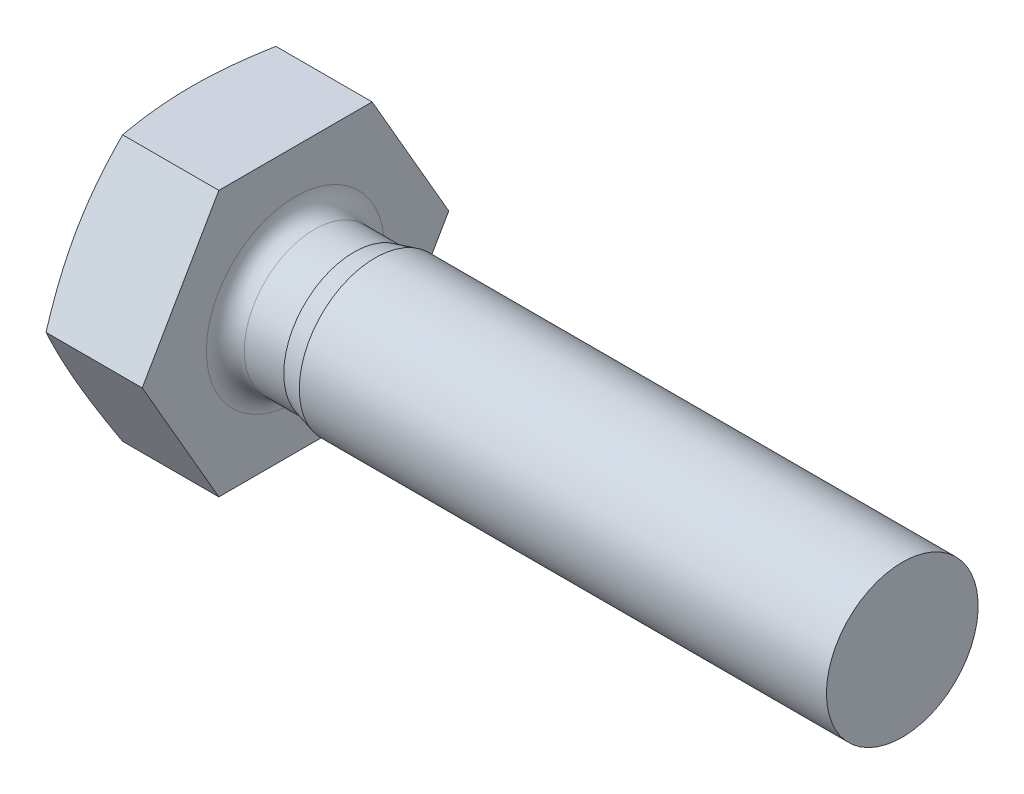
ISO-10303-21;
HEADER;
FILE_DESCRIPTION(('STEP AP214'),'2;1');
FILE_NAME('part.step','',(''),(''),'','','');
FILE_SCHEMA(('AUTOMOTIVE_DESIGN { 1 0 10303 214 1 1 1 1 }'));
ENDSEC;
DATA;
#1=APPLICATION_CONTEXT('core data for automotive mechanical design processes');
#2=APPLICATION_PROTOCOL_DEFINITION('international standard','automotive_design',2000,#1);
#3=PRODUCT_CONTEXT('',#1,'mechanical');
#4=PRODUCT('Part','Part','',(#3));
#5=PRODUCT_RELATED_PRODUCT_CATEGORY('part','',(#4));
#6=PRODUCT_DEFINITION_FORMATION('','',#4);
#7=PRODUCT_DEFINITION_CONTEXT('part definition',#1,'design');
#8=PRODUCT_DEFINITION('design','',#6,#7);
#9=PRODUCT_DEFINITION_SHAPE('','',#8);
#10=(LENGTH_UNIT() NAMED_UNIT(*) SI_UNIT(.MILLI.,.METRE.));
#11=(NAMED_UNIT(*) PLANE_ANGLE_UNIT() SI_UNIT($,.RADIAN.));
#12=(NAMED_UNIT(*) SI_UNIT($,.STERADIAN.) SOLID_ANGLE_UNIT());
#13=UNCERTAINTY_MEASURE_WITH_UNIT(LENGTH_MEASURE(1.E-05),#10,'distance_accuracy_value','');
#14=(GEOMETRIC_REPRESENTATION_CONTEXT(3) GLOBAL_UNCERTAINTY_ASSIGNED_CONTEXT((#13)) GLOBAL_UNIT_ASSIGNED_CONTEXT((#10,
#11,#12)) REPRESENTATION_CONTEXT('',''));
#15=CARTESIAN_POINT('',(0.,0.,0.));
#16=DIRECTION('',(0.,0.,1.));
#17=DIRECTION('',(1.,0.,0.));
#18=AXIS2_PLACEMENT_3D('',#15,#16,#17);
#19=CARTESIAN_POINT('',(1.8,0.,0.));
#20=DIRECTION('',(-1.,0.,0.));
#21=DIRECTION('',(0.,0.,1.));
#22=AXIS2_PLACEMENT_3D('',#19,#20,#21);
#23=PLANE('',#22);
#24=CARTESIAN_POINT('',(1.8,0.,0.));
#25=DIRECTION('',(-1.,0.,0.));
#26=DIRECTION('',(0.,0.,1.));
#27=AXIS2_PLACEMENT_3D('',#24,#25,#26);
#28=CIRCLE('',#27,3.32);
#29=CARTESIAN_POINT('',(1.8,0.,3.32));
#30=VERTEX_POINT('',#29);
#31=EDGE_CURVE('E237',#30,#30,#28,.T.);
#32=ORIENTED_EDGE('',*,*,#31,.T.);
#33=EDGE_LOOP('',(#32));
#34=FACE_BOUND('',#33,.T.);
#35=DIRECTION('',(0.,0.,-1.));
#36=VECTOR('',#35,1.);
#37=CARTESIAN_POINT('',(1.8,2.,0.));
#38=LINE('',#37,#36);
#39=CARTESIAN_POINT('',(1.8,2.,0.385999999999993));
#40=VERTEX_POINT('',#39);
#41=CARTESIAN_POINT('',(1.8,2.,-0.386000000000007));
#42=VERTEX_POINT('',#41);
#43=EDGE_CURVE('E209',#40,#42,#38,.T.);
#44=ORIENTED_EDGE('',*,*,#43,.F.);
#45=DIRECTION('',(0.,-1.,0.));
#46=VECTOR('',#45,1.);
#47=CARTESIAN_POINT('',(1.8,0.,0.386));
#48=LINE('',#47,#46);
#49=CARTESIAN_POINT('',(1.8,0.386,0.385999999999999));
#50=VERTEX_POINT('',#49);
#51=EDGE_CURVE('E199',#40,#50,#48,.T.);
#52=ORIENTED_EDGE('',*,*,#51,.T.);
#53=DIRECTION('',(0.,0.,-1.));
#54=VECTOR('',#53,1.);
#55=CARTESIAN_POINT('',(1.8,0.386,0.));
#56=LINE('',#55,#54);
#57=CARTESIAN_POINT('',(1.8,0.386,2.));
#58=VERTEX_POINT('',#57);
#59=EDGE_CURVE('E698',#58,#50,#56,.T.);
#60=ORIENTED_EDGE('',*,*,#59,.F.);
#61=DIRECTION('',(0.,1.,0.));
#62=VECTOR('',#61,1.);
#63=CARTESIAN_POINT('',(1.8,0.,2.));
#64=LINE('',#63,#62);
#65=CARTESIAN_POINT('',(1.8,-0.386,2.));
#66=VERTEX_POINT('',#65);
#67=EDGE_CURVE('E709',#66,#58,#64,.T.);
#68=ORIENTED_EDGE('',*,*,#67,.F.);
#69=DIRECTION('',(0.,0.,-1.));
#70=VECTOR('',#69,1.);
#71=CARTESIAN_POINT('',(1.8,-0.386,0.));
#72=LINE('',#71,#70);
#73=CARTESIAN_POINT('',(1.8,-0.386,0.386000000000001));
#74=VERTEX_POINT('',#73);
#75=EDGE_CURVE('E713',#66,#74,#72,.T.);
#76=ORIENTED_EDGE('',*,*,#75,.T.);
#77=CARTESIAN_POINT('',(1.8,-2.,0.386000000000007));
#78=VERTEX_POINT('',#77);
#79=EDGE_CURVE('E203',#74,#78,#48,.T.);
#80=ORIENTED_EDGE('',*,*,#79,.T.);
#81=DIRECTION('',(0.,0.,1.));
#82=VECTOR('',#81,1.);
#83=CARTESIAN_POINT('',(1.8,-2.,0.));
#84=LINE('',#83,#82);
#85=CARTESIAN_POINT('',(1.8,-2.,-0.385999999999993));
#86=VERTEX_POINT('',#85);
#87=EDGE_CURVE('E215',#86,#78,#84,.T.);
#88=ORIENTED_EDGE('',*,*,#87,.F.);
#89=DIRECTION('',(0.,-1.,0.));
#90=VECTOR('',#89,1.);
#91=CARTESIAN_POINT('',(1.8,0.,-0.386));
#92=LINE('',#91,#90);
#93=CARTESIAN_POINT('',(1.8,-0.386,-0.385999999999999));
#94=VERTEX_POINT('',#93);
#95=EDGE_CURVE('E196',#94,#86,#92,.T.);
#96=ORIENTED_EDGE('',*,*,#95,.F.);
#97=CARTESIAN_POINT('',(1.8,-0.386,-2.));
#98=VERTEX_POINT('',#97);
#99=EDGE_CURVE('E712',#94,#98,#72,.T.);
#100=ORIENTED_EDGE('',*,*,#99,.T.);
#101=DIRECTION('',(0.,-1.,0.));
#102=VECTOR('',#101,1.);
#103=CARTESIAN_POINT('',(1.8,0.,-2.));
#104=LINE('',#103,#102);
#105=CARTESIAN_POINT('',(1.8,0.386,-2.));
#106=VERTEX_POINT('',#105);
#107=EDGE_CURVE('E706',#106,#98,#104,.T.);
#108=ORIENTED_EDGE('',*,*,#107,.F.);
#109=CARTESIAN_POINT('',(1.8,0.386,-0.386000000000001));
#110=VERTEX_POINT('',#109);
#111=EDGE_CURVE('E694',#110,#106,#56,.T.);
#112=ORIENTED_EDGE('',*,*,#111,.F.);
#113=EDGE_CURVE('E193',#42,#110,#92,.T.);
#114=ORIENTED_EDGE('',*,*,#113,.F.);
#115=EDGE_LOOP('',(#44,#52,#60,#68,#76,#80,#88,#96,#100,#108,#112,#114));
#116=FACE_BOUND('',#115,.T.);
#117=ADVANCED_FACE('F37',(#34,#116),#23,.T.);
#118=CARTESIAN_POINT('',(1.3,-0.386,2.51813471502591));
#119=DIRECTION('',(0.719587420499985,0.,0.694401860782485));
#120=DIRECTION('',(0.694401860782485,0.,-0.719587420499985));
#121=AXIS2_PLACEMENT_3D('',#118,#119,#120);
#122=PLANE('',#121);
#123=DIRECTION('',(0.,1.,0.));
#124=VECTOR('',#123,1.);
#125=CARTESIAN_POINT('',(3.35751,-0.386000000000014,0.386000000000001));
#126=LINE('',#125,#124);
#127=CARTESIAN_POINT('',(3.35751,-0.386,0.386000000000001));
#128=VERTEX_POINT('',#127);
#129=CARTESIAN_POINT('',(3.35751,0.386,0.385999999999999));
#130=VERTEX_POINT('',#129);
#131=EDGE_CURVE('E162',#128,#130,#126,.T.);
#132=ORIENTED_EDGE('',*,*,#131,.F.);
#133=DIRECTION('',(0.694401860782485,0.,-0.719587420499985));
#134=VECTOR('',#133,1.);
#135=CARTESIAN_POINT('',(1.3,-0.386,2.51813471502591));
#136=LINE('',#135,#134);
#137=EDGE_CURVE('E218',#66,#128,#136,.T.);
#138=ORIENTED_EDGE('',*,*,#137,.F.);
#139=ORIENTED_EDGE('',*,*,#67,.T.);
#140=DIRECTION('',(0.694401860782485,0.,-0.719587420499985));
#141=VECTOR('',#140,1.);
#142=CARTESIAN_POINT('',(1.3,0.386,2.51813471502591));
#143=LINE('',#142,#141);
#144=EDGE_CURVE('E226',#58,#130,#143,.T.);
#145=ORIENTED_EDGE('',*,*,#144,.T.);
#146=EDGE_LOOP('',(#132,#138,#139,#145));
#147=FACE_BOUND('',#146,.T.);
#148=ADVANCED_FACE('F324',(#147),#122,.F.);
#149=CARTESIAN_POINT('',(3.73,-0.386,0.));
#150=DIRECTION('',(0.,1.,0.));
#151=DIRECTION('',(0.,0.,1.));
#152=AXIS2_PLACEMENT_3D('',#149,#150,#151);
#153=PLANE('',#152);
#154=ORIENTED_EDGE('',*,*,#137,.T.);
#155=DIRECTION('',(-1.,0.,0.));
#156=VECTOR('',#155,1.);
#157=CARTESIAN_POINT('',(3.73,-0.386,0.386000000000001));
#158=LINE('',#157,#156);
#159=EDGE_CURVE('E202',#128,#74,#158,.T.);
#160=ORIENTED_EDGE('',*,*,#159,.T.);
#161=ORIENTED_EDGE('',*,*,#75,.F.);
#162=EDGE_LOOP('',(#154,#160,#161));
#163=FACE_BOUND('',#162,.T.);
#164=ADVANCED_FACE('F329',(#163),#153,.T.);
#165=CARTESIAN_POINT('',(3.73,0.386,0.));
#166=DIRECTION('',(0.,1.,0.));
#167=DIRECTION('',(0.,0.,1.));
#168=AXIS2_PLACEMENT_3D('',#165,#166,#167);
#169=PLANE('',#168);
#170=DIRECTION('',(-1.,0.,0.));
#171=VECTOR('',#170,1.);
#172=CARTESIAN_POINT('',(3.73,0.386,0.385999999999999));
#173=LINE('',#172,#171);
#174=EDGE_CURVE('E46',#130,#50,#173,.T.);
#175=ORIENTED_EDGE('',*,*,#174,.F.);
#176=ORIENTED_EDGE('',*,*,#144,.F.);
#177=ORIENTED_EDGE('',*,*,#59,.T.);
#178=EDGE_LOOP('',(#175,#176,#177));
#179=FACE_BOUND('',#178,.T.);
#180=ADVANCED_FACE('F351',(#179),#169,.F.);
#181=CARTESIAN_POINT('',(2.8,-3.5,2.02072594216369));
#182=DIRECTION('',(0.,1.,0.));
#183=DIRECTION('',(0.,0.,1.));
#184=AXIS2_PLACEMENT_3D('',#181,#182,#183);
#185=PLANE('',#184);
#186=CARTESIAN_POINT('',(1.11669137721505,-3.5,-5.34393315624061));
#187=CARTESIAN_POINT('',(1.06850938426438,-3.5,-5.18564432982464));
#188=CARTESIAN_POINT('',(1.02089099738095,-3.5,-5.02718074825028));
#189=CARTESIAN_POINT('',(0.927093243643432,-3.5,-4.70981511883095));
#190=CARTESIAN_POINT('',(0.880913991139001,-3.5,-4.55091303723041));
#191=CARTESIAN_POINT('',(0.790229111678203,-3.5,-4.23230809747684));
#192=CARTESIAN_POINT('',(0.745726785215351,-3.5,-4.07260429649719));
#193=CARTESIAN_POINT('',(0.658918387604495,-3.5,-3.75260173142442));
#194=CARTESIAN_POINT('',(0.616612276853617,-3.5,-3.59230297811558));
#195=CARTESIAN_POINT('',(0.53524785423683,-3.5,-3.27299631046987));
#196=CARTESIAN_POINT('',(0.496155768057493,-3.5,-3.11399704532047));
#197=CARTESIAN_POINT('',(0.421309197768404,-3.5,-2.79520645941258));
#198=CARTESIAN_POINT('',(0.385554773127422,-3.5,-2.63541512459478));
#199=CARTESIAN_POINT('',(0.318219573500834,-3.5,-2.31500785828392));
#200=CARTESIAN_POINT('',(0.286637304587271,-3.5,-2.15439224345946));
#201=CARTESIAN_POINT('',(0.228608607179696,-3.5,-1.83222517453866));
#202=CARTESIAN_POINT('',(0.202162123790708,-3.5,-1.67067373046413));
#203=CARTESIAN_POINT('',(0.158100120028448,-3.5,-1.36483588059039));
#204=CARTESIAN_POINT('',(0.139826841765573,-3.5,-1.22064512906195));
#205=CARTESIAN_POINT('',(0.108917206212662,-3.5,-0.931670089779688));
#206=CARTESIAN_POINT('',(0.0962801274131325,-3.5,-0.786885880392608));
#207=CARTESIAN_POINT('',(0.0772483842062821,-3.5,-0.496996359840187));
#208=CARTESIAN_POINT('',(0.0708496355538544,-3.5,-0.351891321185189));
#209=CARTESIAN_POINT('',(0.0646194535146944,-3.5,-0.0615388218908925));
#210=CARTESIAN_POINT('',(0.0647879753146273,-3.5,0.083708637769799));
#211=CARTESIAN_POINT('',(0.071700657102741,-3.5,0.374786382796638));
#212=CARTESIAN_POINT('',(0.0784783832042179,-3.5,0.520615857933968));
#213=CARTESIAN_POINT('',(0.09829814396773,-3.5,0.811844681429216));
#214=CARTESIAN_POINT('',(0.111340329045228,-3.5,0.957244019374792));
#215=CARTESIAN_POINT('',(0.143078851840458,-3.5,1.2475421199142));
#216=CARTESIAN_POINT('',(0.161780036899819,-3.5,1.39244034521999));
#217=CARTESIAN_POINT('',(0.204084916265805,-3.5,1.68150990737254));
#218=CARTESIAN_POINT('',(0.227688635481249,-3.5,1.8256812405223));
#219=CARTESIAN_POINT('',(0.307559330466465,-3.5,2.2732485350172));
#220=CARTESIAN_POINT('',(0.370953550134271,-3.5,2.57536900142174));
#221=CARTESIAN_POINT('',(0.509931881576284,-3.5,3.17680072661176));
#222=CARTESIAN_POINT('',(0.58552040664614,-3.5,3.47611092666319));
#223=CARTESIAN_POINT('',(0.74481592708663,-3.5,4.07295830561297));
#224=CARTESIAN_POINT('',(0.828533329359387,-3.5,4.37049267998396));
#225=CARTESIAN_POINT('',(1.00134083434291,-3.5,4.96392973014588));
#226=CARTESIAN_POINT('',(1.09043007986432,-3.5,5.25983265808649));
#227=CARTESIAN_POINT('',(1.27130419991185,-3.5,5.8471785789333));
#228=CARTESIAN_POINT('',(1.36304766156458,-3.5,6.13863438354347));
#229=CARTESIAN_POINT('',(1.54913199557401,-3.5,6.72072836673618));
#230=CARTESIAN_POINT('',(1.643472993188,-3.5,7.0113665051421));
#231=CARTESIAN_POINT('',(1.83368573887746,-3.5,7.59091730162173));
#232=CARTESIAN_POINT('',(1.92955031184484,-3.5,7.87983232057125));
#233=CARTESIAN_POINT('',(2.12271150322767,-3.5,8.45715716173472));
#234=CARTESIAN_POINT('',(2.22000800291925,-3.5,8.74556702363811));
#235=CARTESIAN_POINT('',(2.31780528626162,-3.5,9.03380453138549));
#236=B_SPLINE_CURVE_WITH_KNOTS('',3,(#186,#187,#188,#189,#190,#191,#192,#193,#194,#195,#196,
#197,#198,#199,#200,#201,#202,#203,#204,#205,#206,#207,#208,#209,#210,#211,#212,#213,#214,#215,
#216,#217,#218,#219,#220,#221,#222,#223,#224,#225,#226,#227,#228,#229,#230,#231,#232,#233,#234,
#235),.UNSPECIFIED.,.F.,.F.,(4,2,2,2,2,2,2,2,2,2,2,2,2,2,2,2,2,2,2,2,2,2,2,2,4),(0.,
0.49638213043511,0.992803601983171,1.49015588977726,1.98749920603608,2.47867397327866,
2.96985749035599,3.46086464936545,3.95186655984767,4.38780272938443,4.82368307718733,
5.25927786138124,5.69486967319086,6.13268530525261,6.57051145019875,7.00871369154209,
7.44691815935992,8.37256634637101,9.29855029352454,10.2257357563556,11.1527736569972,
12.0694195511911,12.9861097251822,13.8993181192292,14.8124512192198),.UNSPECIFIED.);
#237=CARTESIAN_POINT('',(0.262587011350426,-3.5,-2.02072594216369));
#238=VERTEX_POINT('',#237);
#239=CARTESIAN_POINT('',(0.262587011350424,-3.5,2.02072594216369));
#240=VERTEX_POINT('',#239);
#241=EDGE_CURVE('E295',#238,#240,#236,.T.);
#242=ORIENTED_EDGE('',*,*,#241,.F.);
#243=DIRECTION('',(-1.,0.,0.));
#244=VECTOR('',#243,1.);
#245=CARTESIAN_POINT('',(2.8,-3.5,-2.02072594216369));
#246=LINE('',#245,#244);
#247=CARTESIAN_POINT('',(2.8,-3.5,-2.02072594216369));
#248=VERTEX_POINT('',#247);
#249=EDGE_CURVE('E692',#248,#238,#246,.T.);
#250=ORIENTED_EDGE('',*,*,#249,.F.);
#251=DIRECTION('',(0.,0.,-1.));
#252=VECTOR('',#251,1.);
#253=CARTESIAN_POINT('',(2.8,-3.5,2.02072594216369));
#254=LINE('',#253,#252);
#255=CARTESIAN_POINT('',(2.8,-3.5,2.02072594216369));
#256=VERTEX_POINT('',#255);
#257=EDGE_CURVE('E680',#256,#248,#254,.T.);
#258=ORIENTED_EDGE('',*,*,#257,.F.);
#259=DIRECTION('',(-1.,0.,0.));
#260=VECTOR('',#259,1.);
#261=CARTESIAN_POINT('',(2.8,-3.5,2.02072594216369));
#262=LINE('',#261,#260);
#263=EDGE_CURVE('E760',#256,#240,#262,.T.);
#264=ORIENTED_EDGE('',*,*,#263,.T.);
#265=EDGE_LOOP('',(#242,#250,#258,#264));
#266=FACE_BOUND('',#265,.T.);
#267=ADVANCED_FACE('F39',(#266),#185,.F.);
#268=CARTESIAN_POINT('',(2.8,-3.5,-2.02072594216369));
#269=DIRECTION('',(0.,0.5,0.866025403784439));
#270=DIRECTION('',(0.,-0.866025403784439,0.5));
#271=AXIS2_PLACEMENT_3D('',#268,#269,#270);
#272=PLANE('',#271);
#273=CARTESIAN_POINT('',(0.262629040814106,0.000199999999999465,-4.04156735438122));
#274=CARTESIAN_POINT('',(0.232154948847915,-0.144759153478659,-3.95787514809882));
#275=CARTESIAN_POINT('',(0.204433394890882,-0.290196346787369,-3.87390694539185));
#276=CARTESIAN_POINT('',(0.155661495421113,-0.582016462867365,-3.70542452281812));
#277=CARTESIAN_POINT('',(0.134616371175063,-0.728400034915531,-3.62090992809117));
#278=CARTESIAN_POINT('',(0.100576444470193,-1.02048824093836,-3.45227272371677));
#279=CARTESIAN_POINT('',(0.0875073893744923,-1.16618620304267,-3.36815396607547));
#280=CARTESIAN_POINT('',(0.0699781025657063,-1.45792287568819,-3.1997197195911));
#281=CARTESIAN_POINT('',(0.0655146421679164,-1.60396143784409,-3.11540431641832));
#282=CARTESIAN_POINT('',(0.0655146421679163,-1.89603856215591,-2.94677351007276));
#283=CARTESIAN_POINT('',(0.0699781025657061,-2.04207712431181,-2.86245810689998));
#284=CARTESIAN_POINT('',(0.0875073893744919,-2.33381379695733,-2.69402386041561));
#285=CARTESIAN_POINT('',(0.100576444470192,-2.47951175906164,-2.6099051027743));
#286=CARTESIAN_POINT('',(0.134616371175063,-2.77159996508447,-2.44126789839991));
#287=CARTESIAN_POINT('',(0.155661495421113,-2.91798353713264,-2.35675330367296));
#288=CARTESIAN_POINT('',(0.204433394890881,-3.20980365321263,-2.18827088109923));
#289=CARTESIAN_POINT('',(0.232154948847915,-3.35524084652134,-2.10430267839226));
#290=CARTESIAN_POINT('',(0.262629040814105,-3.5002,-2.02061047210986));
#291=B_SPLINE_CURVE_WITH_KNOTS('',3,(#273,#274,#275,#276,#277,#278,#279,#280,#281,#282,#283,
#284,#285,#286,#287,#288,#289,#290),.UNSPECIFIED.,.F.,.F.,(4,2,2,2,2,2,2,2,4),(0.,
0.510460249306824,1.02131872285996,1.52734581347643,2.03318301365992,2.53902021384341,
3.04504730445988,3.55590577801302,4.06636602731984),.UNSPECIFIED.);
#292=CARTESIAN_POINT('',(0.262587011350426,0.,-4.04145188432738));
#293=VERTEX_POINT('',#292);
#294=EDGE_CURVE('E290',#293,#238,#291,.T.);
#295=ORIENTED_EDGE('',*,*,#294,.F.);
#296=DIRECTION('',(-1.,0.,0.));
#297=VECTOR('',#296,1.);
#298=CARTESIAN_POINT('',(2.8,0.,-4.04145188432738));
#299=LINE('',#298,#297);
#300=CARTESIAN_POINT('',(2.8,0.,-4.04145188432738));
#301=VERTEX_POINT('',#300);
#302=EDGE_CURVE('E695',#301,#293,#299,.T.);
#303=ORIENTED_EDGE('',*,*,#302,.F.);
#304=DIRECTION('',(0.,0.866025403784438,-0.5));
#305=VECTOR('',#304,1.);
#306=CARTESIAN_POINT('',(2.8,-3.5,-2.02072594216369));
#307=LINE('',#306,#305);
#308=EDGE_CURVE('E682',#248,#301,#307,.T.);
#309=ORIENTED_EDGE('',*,*,#308,.F.);
#310=ORIENTED_EDGE('',*,*,#249,.T.);
#311=EDGE_LOOP('',(#295,#303,#309,#310));
#312=FACE_BOUND('',#311,.T.);
#313=ADVANCED_FACE('F301',(#312),#272,.F.);
#314=CARTESIAN_POINT('',(2.8,0.,-4.04145188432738));
#315=DIRECTION('',(0.,-0.5,0.866025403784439));
#316=DIRECTION('',(0.,-0.866025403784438,-0.5));
#317=AXIS2_PLACEMENT_3D('',#314,#315,#316);
#318=PLANE('',#317);
#319=CARTESIAN_POINT('',(0.262629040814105,3.5002,-2.02061047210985));
#320=CARTESIAN_POINT('',(0.232154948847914,3.35524084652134,-2.10430267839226));
#321=CARTESIAN_POINT('',(0.204433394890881,3.20980365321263,-2.18827088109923));
#322=CARTESIAN_POINT('',(0.155661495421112,2.91798353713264,-2.35675330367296));
#323=CARTESIAN_POINT('',(0.134616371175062,2.77159996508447,-2.44126789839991));
#324=CARTESIAN_POINT('',(0.100576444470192,2.47951175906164,-2.6099051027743));
#325=CARTESIAN_POINT('',(0.0875073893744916,2.33381379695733,-2.69402386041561));
#326=CARTESIAN_POINT('',(0.0699781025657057,2.04207712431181,-2.86245810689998));
#327=CARTESIAN_POINT('',(0.0655146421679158,1.89603856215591,-2.94677351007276));
#328=CARTESIAN_POINT('',(0.0655146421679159,1.60396143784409,-3.11540431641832));
#329=CARTESIAN_POINT('',(0.0699781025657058,1.45792287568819,-3.19971971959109));
#330=CARTESIAN_POINT('',(0.0875073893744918,1.16618620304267,-3.36815396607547));
#331=CARTESIAN_POINT('',(0.100576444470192,1.02048824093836,-3.45227272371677));
#332=CARTESIAN_POINT('',(0.134616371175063,0.72840003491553,-3.62090992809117));
#333=CARTESIAN_POINT('',(0.155661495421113,0.582016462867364,-3.70542452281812));
#334=CARTESIAN_POINT('',(0.204433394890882,0.290196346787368,-3.87390694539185));
#335=CARTESIAN_POINT('',(0.232154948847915,0.144759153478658,-3.95787514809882));
#336=CARTESIAN_POINT('',(0.262629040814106,-0.000200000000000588,-4.04156735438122));
#337=B_SPLINE_CURVE_WITH_KNOTS('',3,(#319,#320,#321,#322,#323,#324,#325,#326,#327,#328,#329,
#330,#331,#332,#333,#334,#335,#336),.UNSPECIFIED.,.F.,.F.,(4,2,2,2,2,2,2,2,4),(0.,
0.510460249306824,1.02131872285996,1.52734581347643,2.03318301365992,2.53902021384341,
3.04504730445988,3.55590577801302,4.06636602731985),.UNSPECIFIED.);
#338=CARTESIAN_POINT('',(0.262587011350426,3.5,-2.0207259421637));
#339=VERTEX_POINT('',#338);
#340=EDGE_CURVE('E283',#339,#293,#337,.T.);
#341=ORIENTED_EDGE('',*,*,#340,.F.);
#342=DIRECTION('',(-1.,0.,0.));
#343=VECTOR('',#342,1.);
#344=CARTESIAN_POINT('',(2.8,3.5,-2.02072594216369));
#345=LINE('',#344,#343);
#346=CARTESIAN_POINT('',(2.8,3.5,-2.02072594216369));
#347=VERTEX_POINT('',#346);
#348=EDGE_CURVE('E701',#347,#339,#345,.T.);
#349=ORIENTED_EDGE('',*,*,#348,.F.);
#350=DIRECTION('',(0.,0.866025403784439,0.5));
#351=VECTOR('',#350,1.);
#352=CARTESIAN_POINT('',(2.8,0.,-4.04145188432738));
#353=LINE('',#352,#351);
#354=EDGE_CURVE('E767',#301,#347,#353,.T.);
#355=ORIENTED_EDGE('',*,*,#354,.F.);
#356=ORIENTED_EDGE('',*,*,#302,.T.);
#357=EDGE_LOOP('',(#341,#349,#355,#356));
#358=FACE_BOUND('',#357,.T.);
#359=ADVANCED_FACE('F304',(#358),#318,.F.);
#360=CARTESIAN_POINT('',(2.8,3.5,-2.02072594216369));
#361=DIRECTION('',(0.,-1.,0.));
#362=DIRECTION('',(0.,0.,-1.));
#363=AXIS2_PLACEMENT_3D('',#360,#361,#362);
#364=PLANE('',#363);
#365=CARTESIAN_POINT('',(1.11669137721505,3.5,-5.34393315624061));
#366=CARTESIAN_POINT('',(1.06850938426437,3.5,-5.18564432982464));
#367=CARTESIAN_POINT('',(1.02089099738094,3.5,-5.02718074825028));
#368=CARTESIAN_POINT('',(0.92709324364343,3.5,-4.70981511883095));
#369=CARTESIAN_POINT('',(0.880913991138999,3.5,-4.55091303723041));
#370=CARTESIAN_POINT('',(0.790229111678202,3.5,-4.23230809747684));
#371=CARTESIAN_POINT('',(0.745726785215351,3.5,-4.07260429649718));
#372=CARTESIAN_POINT('',(0.658918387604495,3.5,-3.75260173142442));
#373=CARTESIAN_POINT('',(0.616612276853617,3.5,-3.59230297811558));
#374=CARTESIAN_POINT('',(0.535247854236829,3.5,-3.27299631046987));
#375=CARTESIAN_POINT('',(0.496155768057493,3.5,-3.11399704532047));
#376=CARTESIAN_POINT('',(0.421309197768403,3.5,-2.79520645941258));
#377=CARTESIAN_POINT('',(0.385554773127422,3.5,-2.63541512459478));
#378=CARTESIAN_POINT('',(0.318219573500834,3.5,-2.31500785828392));
#379=CARTESIAN_POINT('',(0.28663730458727,3.5,-2.15439224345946));
#380=CARTESIAN_POINT('',(0.228608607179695,3.5,-1.83222517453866));
#381=CARTESIAN_POINT('',(0.202162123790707,3.5,-1.67067373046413));
#382=CARTESIAN_POINT('',(0.158100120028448,3.5,-1.36483588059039));
#383=CARTESIAN_POINT('',(0.139826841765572,3.5,-1.22064512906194));
#384=CARTESIAN_POINT('',(0.108917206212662,3.5,-0.931670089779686));
#385=CARTESIAN_POINT('',(0.0962801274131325,3.5,-0.786885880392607));
#386=CARTESIAN_POINT('',(0.0772483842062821,3.5,-0.496996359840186));
#387=CARTESIAN_POINT('',(0.0708496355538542,3.5,-0.351891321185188));
#388=CARTESIAN_POINT('',(0.0646194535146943,3.5,-0.0615388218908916));
#389=CARTESIAN_POINT('',(0.0647879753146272,3.5,0.0837086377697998));
#390=CARTESIAN_POINT('',(0.0717006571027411,3.5,0.374786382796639));
#391=CARTESIAN_POINT('',(0.0784783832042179,3.5,0.520615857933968));
#392=CARTESIAN_POINT('',(0.09829814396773,3.5,0.811844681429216));
#393=CARTESIAN_POINT('',(0.111340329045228,3.5,0.957244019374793));
#394=CARTESIAN_POINT('',(0.143078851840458,3.5,1.2475421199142));
#395=CARTESIAN_POINT('',(0.161780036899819,3.5,1.39244034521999));
#396=CARTESIAN_POINT('',(0.204084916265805,3.5,1.68150990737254));
#397=CARTESIAN_POINT('',(0.227688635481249,3.5,1.8256812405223));
#398=CARTESIAN_POINT('',(0.307559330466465,3.5,2.2732485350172));
#399=CARTESIAN_POINT('',(0.370953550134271,3.5,2.57536900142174));
#400=CARTESIAN_POINT('',(0.509931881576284,3.5,3.17680072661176));
#401=CARTESIAN_POINT('',(0.58552040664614,3.5,3.47611092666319));
#402=CARTESIAN_POINT('',(0.744815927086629,3.5,4.07295830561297));
#403=CARTESIAN_POINT('',(0.828533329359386,3.5,4.37049267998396));
#404=CARTESIAN_POINT('',(1.00134083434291,3.5,4.96392973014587));
#405=CARTESIAN_POINT('',(1.09043007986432,3.5,5.25983265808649));
#406=CARTESIAN_POINT('',(1.27130419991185,3.5,5.8471785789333));
#407=CARTESIAN_POINT('',(1.36304766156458,3.5,6.13863438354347));
#408=CARTESIAN_POINT('',(1.54913199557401,3.5,6.72072836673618));
#409=CARTESIAN_POINT('',(1.643472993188,3.5,7.0113665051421));
#410=CARTESIAN_POINT('',(1.83368573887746,3.5,7.59091730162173));
#411=CARTESIAN_POINT('',(1.92955031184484,3.5,7.87983232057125));
#412=CARTESIAN_POINT('',(2.12271150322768,3.5,8.45715716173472));
#413=CARTESIAN_POINT('',(2.22000800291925,3.5,8.74556702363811));
#414=CARTESIAN_POINT('',(2.31780528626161,3.5,9.03380453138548));
#415=B_SPLINE_CURVE_WITH_KNOTS('',3,(#365,#366,#367,#368,#369,#370,#371,#372,#373,#374,#375,
#376,#377,#378,#379,#380,#381,#382,#383,#384,#385,#386,#387,#388,#389,#390,#391,#392,#393,#394,
#395,#396,#397,#398,#399,#400,#401,#402,#403,#404,#405,#406,#407,#408,#409,#410,#411,#412,#413,
#414),.UNSPECIFIED.,.F.,.F.,(4,2,2,2,2,2,2,2,2,2,2,2,2,2,2,2,2,2,2,2,2,2,2,2,4),(0.,
0.496382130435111,0.992803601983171,1.49015588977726,1.98749920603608,2.47867397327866,
2.96985749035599,3.46086464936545,3.95186655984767,4.38780272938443,4.82368307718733,
5.25927786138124,5.69486967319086,6.13268530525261,6.57051145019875,7.00871369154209,
7.44691815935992,8.372566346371,9.29855029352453,10.2257357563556,11.1527736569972,
12.0694195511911,12.9861097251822,13.8993181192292,14.8124512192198),.UNSPECIFIED.);
#416=CARTESIAN_POINT('',(0.262587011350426,3.50000000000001,2.02072594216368));
#417=VERTEX_POINT('',#416);
#418=EDGE_CURVE('E276',#417,#339,#415,.F.);
#419=ORIENTED_EDGE('',*,*,#418,.F.);
#420=DIRECTION('',(-1.,0.,0.));
#421=VECTOR('',#420,1.);
#422=CARTESIAN_POINT('',(2.8,3.5,2.02072594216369));
#423=LINE('',#422,#421);
#424=CARTESIAN_POINT('',(2.8,3.5,2.02072594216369));
#425=VERTEX_POINT('',#424);
#426=EDGE_CURVE('E754',#425,#417,#423,.T.);
#427=ORIENTED_EDGE('',*,*,#426,.F.);
#428=DIRECTION('',(0.,0.,1.));
#429=VECTOR('',#428,1.);
#430=CARTESIAN_POINT('',(2.8,3.5,-2.02072594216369));
#431=LINE('',#430,#429);
#432=EDGE_CURVE('E765',#347,#425,#431,.T.);
#433=ORIENTED_EDGE('',*,*,#432,.F.);
#434=ORIENTED_EDGE('',*,*,#348,.T.);
#435=EDGE_LOOP('',(#419,#427,#433,#434));
#436=FACE_BOUND('',#435,.T.);
#437=ADVANCED_FACE('F308',(#436),#364,.F.);
#438=CARTESIAN_POINT('',(2.8,3.5,2.02072594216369));
#439=DIRECTION('',(0.,-0.5,-0.866025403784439));
#440=DIRECTION('',(0.,0.866025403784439,-0.5));
#441=AXIS2_PLACEMENT_3D('',#438,#439,#440);
#442=PLANE('',#441);
#443=CARTESIAN_POINT('',(0.262629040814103,-0.000199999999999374,4.04156735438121));
#444=CARTESIAN_POINT('',(0.232154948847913,0.144759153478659,3.95787514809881));
#445=CARTESIAN_POINT('',(0.204433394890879,0.290196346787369,3.87390694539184));
#446=CARTESIAN_POINT('',(0.15566149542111,0.582016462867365,3.70542452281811));
#447=CARTESIAN_POINT('',(0.134616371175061,0.728400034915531,3.62090992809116));
#448=CARTESIAN_POINT('',(0.10057644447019,1.02048824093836,3.45227272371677));
#449=CARTESIAN_POINT('',(0.0875073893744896,1.16618620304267,3.36815396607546));
#450=CARTESIAN_POINT('',(0.0699781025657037,1.45792287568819,3.19971971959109));
#451=CARTESIAN_POINT('',(0.0655146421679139,1.6039614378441,3.11540431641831));
#452=CARTESIAN_POINT('',(0.065514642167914,1.89603856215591,2.94677351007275));
#453=CARTESIAN_POINT('',(0.0699781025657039,2.04207712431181,2.86245810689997));
#454=CARTESIAN_POINT('',(0.0875073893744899,2.33381379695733,2.6940238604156));
#455=CARTESIAN_POINT('',(0.10057644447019,2.47951175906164,2.6099051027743));
#456=CARTESIAN_POINT('',(0.134616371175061,2.77159996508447,2.4412678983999));
#457=CARTESIAN_POINT('',(0.155661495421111,2.91798353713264,2.35675330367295));
#458=CARTESIAN_POINT('',(0.20443339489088,3.20980365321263,2.18827088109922));
#459=CARTESIAN_POINT('',(0.232154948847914,3.35524084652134,2.10430267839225));
#460=CARTESIAN_POINT('',(0.262629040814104,3.5002,2.02061047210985));
#461=B_SPLINE_CURVE_WITH_KNOTS('',3,(#443,#444,#445,#446,#447,#448,#449,#450,#451,#452,#453,
#454,#455,#456,#457,#458,#459,#460),.UNSPECIFIED.,.F.,.F.,(4,2,2,2,2,2,2,2,4),(0.,
0.510460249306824,1.02131872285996,1.52734581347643,2.03318301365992,2.53902021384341,
3.04504730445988,3.55590577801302,4.06636602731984),.UNSPECIFIED.);
#462=CARTESIAN_POINT('',(0.262587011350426,0.,4.04145188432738));
#463=VERTEX_POINT('',#462);
#464=EDGE_CURVE('E250',#463,#417,#461,.T.);
#465=ORIENTED_EDGE('',*,*,#464,.F.);
#466=DIRECTION('',(-1.,0.,0.));
#467=VECTOR('',#466,1.);
#468=CARTESIAN_POINT('',(2.8,0.,4.04145188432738));
#469=LINE('',#468,#467);
#470=CARTESIAN_POINT('',(2.8,0.,4.04145188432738));
#471=VERTEX_POINT('',#470);
#472=EDGE_CURVE('E757',#471,#463,#469,.T.);
#473=ORIENTED_EDGE('',*,*,#472,.F.);
#474=DIRECTION('',(0.,-0.866025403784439,0.5));
#475=VECTOR('',#474,1.);
#476=CARTESIAN_POINT('',(2.8,3.5,2.02072594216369));
#477=LINE('',#476,#475);
#478=EDGE_CURVE('E763',#425,#471,#477,.T.);
#479=ORIENTED_EDGE('',*,*,#478,.F.);
#480=ORIENTED_EDGE('',*,*,#426,.T.);
#481=EDGE_LOOP('',(#465,#473,#479,#480));
#482=FACE_BOUND('',#481,.T.);
#483=ADVANCED_FACE('F312',(#482),#442,.F.);
#484=CARTESIAN_POINT('',(2.8,0.,4.04145188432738));
#485=DIRECTION('',(0.,0.5,-0.866025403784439));
#486=DIRECTION('',(0.,0.866025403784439,0.5));
#487=AXIS2_PLACEMENT_3D('',#484,#485,#486);
#488=PLANE('',#487);
#489=CARTESIAN_POINT('',(0.262629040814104,-3.5002,2.02061047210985));
#490=CARTESIAN_POINT('',(0.232154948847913,-3.35524084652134,2.10430267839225));
#491=CARTESIAN_POINT('',(0.20443339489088,-3.20980365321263,2.18827088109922));
#492=CARTESIAN_POINT('',(0.155661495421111,-2.91798353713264,2.35675330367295));
#493=CARTESIAN_POINT('',(0.134616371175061,-2.77159996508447,2.4412678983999));
#494=CARTESIAN_POINT('',(0.10057644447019,-2.47951175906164,2.6099051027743));
#495=CARTESIAN_POINT('',(0.0875073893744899,-2.33381379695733,2.6940238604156));
#496=CARTESIAN_POINT('',(0.0699781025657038,-2.04207712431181,2.86245810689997));
#497=CARTESIAN_POINT('',(0.0655146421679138,-1.89603856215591,2.94677351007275));
#498=CARTESIAN_POINT('',(0.0655146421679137,-1.60396143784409,3.11540431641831));
#499=CARTESIAN_POINT('',(0.0699781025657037,-1.45792287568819,3.19971971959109));
#500=CARTESIAN_POINT('',(0.0875073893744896,-1.16618620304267,3.36815396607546));
#501=CARTESIAN_POINT('',(0.10057644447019,-1.02048824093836,3.45227272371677));
#502=CARTESIAN_POINT('',(0.13461637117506,-0.72840003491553,3.62090992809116));
#503=CARTESIAN_POINT('',(0.155661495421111,-0.582016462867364,3.70542452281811));
#504=CARTESIAN_POINT('',(0.204433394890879,-0.290196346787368,3.87390694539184));
#505=CARTESIAN_POINT('',(0.232154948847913,-0.144759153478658,3.95787514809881));
#506=CARTESIAN_POINT('',(0.262629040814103,0.000200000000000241,4.04156735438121));
#507=B_SPLINE_CURVE_WITH_KNOTS('',3,(#489,#490,#491,#492,#493,#494,#495,#496,#497,#498,#499,
#500,#501,#502,#503,#504,#505,#506),.UNSPECIFIED.,.F.,.F.,(4,2,2,2,2,2,2,2,4),(0.,
0.510460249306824,1.02131872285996,1.52734581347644,2.03318301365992,2.53902021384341,
3.04504730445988,3.55590577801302,4.06636602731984),.UNSPECIFIED.);
#508=EDGE_CURVE('E240',#240,#463,#507,.T.);
#509=ORIENTED_EDGE('',*,*,#508,.F.);
#510=ORIENTED_EDGE('',*,*,#263,.F.);
#511=DIRECTION('',(0.,-0.866025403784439,-0.5));
#512=VECTOR('',#511,1.);
#513=CARTESIAN_POINT('',(2.8,0.,4.04145188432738));
#514=LINE('',#513,#512);
#515=EDGE_CURVE('E685',#471,#256,#514,.T.);
#516=ORIENTED_EDGE('',*,*,#515,.F.);
#517=ORIENTED_EDGE('',*,*,#472,.T.);
#518=EDGE_LOOP('',(#509,#510,#516,#517));
#519=FACE_BOUND('',#518,.T.);
#520=ADVANCED_FACE('F257',(#519),#488,.F.);
#521=CARTESIAN_POINT('',(2.8,-3.5,2.02072594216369));
#522=DIRECTION('',(-1.,0.,0.));
#523=DIRECTION('',(0.,0.,1.));
#524=AXIS2_PLACEMENT_3D('',#521,#522,#523);
#525=PLANE('',#524);
#526=CARTESIAN_POINT('',(2.8,0.,0.));
#527=DIRECTION('',(-1.,0.,0.));
#528=DIRECTION('',(0.,0.,1.));
#529=AXIS2_PLACEMENT_3D('',#526,#527,#528);
#530=CIRCLE('',#529,2.35);
#531=CARTESIAN_POINT('',(2.8,0.,2.35));
#532=VERTEX_POINT('',#531);
#533=EDGE_CURVE('E677',#532,#532,#530,.T.);
#534=ORIENTED_EDGE('',*,*,#533,.T.);
#535=EDGE_LOOP('',(#534));
#536=FACE_BOUND('',#535,.T.);
#537=ORIENTED_EDGE('',*,*,#257,.T.);
#538=ORIENTED_EDGE('',*,*,#308,.T.);
#539=ORIENTED_EDGE('',*,*,#354,.T.);
#540=ORIENTED_EDGE('',*,*,#432,.T.);
#541=ORIENTED_EDGE('',*,*,#478,.T.);
#542=ORIENTED_EDGE('',*,*,#515,.T.);
#543=EDGE_LOOP('',(#537,#538,#539,#540,#541,#542));
#544=FACE_BOUND('',#543,.T.);
#545=ADVANCED_FACE('F320',(#536,#544),#525,.F.);
#546=CARTESIAN_POINT('',(18.8,0.,0.));
#547=DIRECTION('',(-1.,0.,0.));
#548=DIRECTION('',(0.,0.,1.));
#549=AXIS2_PLACEMENT_3D('',#546,#547,#548);
#550=PLANE('',#549);
#551=CARTESIAN_POINT('',(18.8,0.,0.));
#552=DIRECTION('',(-1.,0.,0.));
#553=DIRECTION('',(0.,0.,1.));
#554=AXIS2_PLACEMENT_3D('',#551,#552,#553);
#555=CIRCLE('',#554,2.);
#556=CARTESIAN_POINT('',(18.8,0.,2.));
#557=VERTEX_POINT('',#556);
#558=EDGE_CURVE('E688',#557,#557,#555,.T.);
#559=ORIENTED_EDGE('',*,*,#558,.F.);
#560=EDGE_LOOP('',(#559));
#561=FACE_BOUND('',#560,.T.);
#562=ADVANCED_FACE('F472',(#561),#550,.F.);
#563=CARTESIAN_POINT('',(0.,0.,0.));
#564=DIRECTION('',(-1.,0.,0.));
#565=DIRECTION('',(0.,0.,1.));
#566=AXIS2_PLACEMENT_3D('',#563,#564,#565);
#567=CYLINDRICAL_SURFACE('',#566,2.);
#568=CARTESIAN_POINT('',(4.9,0.,0.));
#569=DIRECTION('',(-1.,0.,0.));
#570=DIRECTION('',(0.,0.,1.));
#571=AXIS2_PLACEMENT_3D('',#568,#569,#570);
#572=CIRCLE('',#571,2.);
#573=CARTESIAN_POINT('',(4.9,0.,2.));
#574=VERTEX_POINT('',#573);
#575=EDGE_CURVE('E772',#574,#574,#572,.T.);
#576=ORIENTED_EDGE('',*,*,#575,.F.);
#577=EDGE_LOOP('',(#576));
#578=FACE_BOUND('',#577,.T.);
#579=ORIENTED_EDGE('',*,*,#558,.T.);
#580=EDGE_LOOP('',(#579));
#581=FACE_BOUND('',#580,.T.);
#582=ADVANCED_FACE('F467',(#578,#581),#567,.T.);
#583=CARTESIAN_POINT('',(4.9,0.,0.));
#584=DIRECTION('',(1.,0.,0.));
#585=DIRECTION('',(0.,0.,-1.));
#586=AXIS2_PLACEMENT_3D('',#583,#584,#585);
#587=CONICAL_SURFACE('',#586,2.,0.261799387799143);
#588=CARTESIAN_POINT('',(4.34019237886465,0.,0.));
#589=DIRECTION('',(-1.,0.,0.));
#590=DIRECTION('',(0.,0.,1.));
#591=AXIS2_PLACEMENT_3D('',#588,#589,#590);
#592=CIRCLE('',#591,1.85);
#593=CARTESIAN_POINT('',(4.34019237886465,0.,1.85));
#594=VERTEX_POINT('',#593);
#595=EDGE_CURVE('E775',#594,#594,#592,.T.);
#596=ORIENTED_EDGE('',*,*,#595,.F.);
#597=EDGE_LOOP('',(#596));
#598=FACE_BOUND('',#597,.T.);
#599=ORIENTED_EDGE('',*,*,#575,.T.);
#600=EDGE_LOOP('',(#599));
#601=FACE_BOUND('',#600,.T.);
#602=ADVANCED_FACE('F471',(#598,#601),#587,.T.);
#603=CARTESIAN_POINT('',(0.,0.,0.));
#604=DIRECTION('',(-1.,0.,0.));
#605=DIRECTION('',(0.,0.,1.));
#606=AXIS2_PLACEMENT_3D('',#603,#604,#605);
#607=CYLINDRICAL_SURFACE('',#606,1.85);
#608=CARTESIAN_POINT('',(3.3,0.,0.));
#609=DIRECTION('',(-1.,0.,0.));
#610=DIRECTION('',(0.,0.,1.));
#611=AXIS2_PLACEMENT_3D('',#608,#609,#610);
#612=CIRCLE('',#611,1.85);
#613=CARTESIAN_POINT('',(3.3,0.,1.85));
#614=VERTEX_POINT('',#613);
#615=EDGE_CURVE('E778',#614,#614,#612,.T.);
#616=ORIENTED_EDGE('',*,*,#615,.F.);
#617=EDGE_LOOP('',(#616));
#618=FACE_BOUND('',#617,.T.);
#619=ORIENTED_EDGE('',*,*,#595,.T.);
#620=EDGE_LOOP('',(#619));
#621=FACE_BOUND('',#620,.T.);
#622=ADVANCED_FACE('F486',(#618,#621),#607,.T.);
#623=CARTESIAN_POINT('',(3.3,0.,0.));
#624=DIRECTION('',(-1.,0.,0.));
#625=DIRECTION('',(0.,0.,1.));
#626=AXIS2_PLACEMENT_3D('',#623,#624,#625);
#627=TOROIDAL_SURFACE('',#626,2.35,0.5);
#628=ORIENTED_EDGE('',*,*,#533,.F.);
#629=EDGE_LOOP('',(#628));
#630=FACE_BOUND('',#629,.T.);
#631=ORIENTED_EDGE('',*,*,#615,.T.);
#632=EDGE_LOOP('',(#631));
#633=FACE_BOUND('',#632,.T.);
#634=ADVANCED_FACE('F266',(#630,#633),#627,.F.);
#635=CARTESIAN_POINT('',(0.,0.,0.));
#636=DIRECTION('',(1.,0.,0.));
#637=DIRECTION('',(0.,0.,-1.));
#638=AXIS2_PLACEMENT_3D('',#635,#636,#637);
#639=CONICAL_SURFACE('',#638,3.32,1.22173047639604);
#640=CARTESIAN_POINT('',(0.,0.,0.));
#641=DIRECTION('',(-1.,0.,0.));
#642=DIRECTION('',(0.,0.,1.));
#643=AXIS2_PLACEMENT_3D('',#640,#641,#642);
#644=CIRCLE('',#643,3.32);
#645=CARTESIAN_POINT('',(0.,0.,3.32));
#646=VERTEX_POINT('',#645);
#647=EDGE_CURVE('E236',#646,#646,#644,.T.);
#648=ORIENTED_EDGE('',*,*,#647,.F.);
#649=EDGE_LOOP('',(#648));
#650=FACE_BOUND('',#649,.T.);
#651=ORIENTED_EDGE('',*,*,#241,.T.);
#652=ORIENTED_EDGE('',*,*,#508,.T.);
#653=ORIENTED_EDGE('',*,*,#464,.T.);
#654=ORIENTED_EDGE('',*,*,#418,.T.);
#655=ORIENTED_EDGE('',*,*,#340,.T.);
#656=ORIENTED_EDGE('',*,*,#294,.T.);
#657=EDGE_LOOP('',(#651,#652,#653,#654,#655,#656));
#658=FACE_BOUND('',#657,.T.);
#659=ADVANCED_FACE('F260',(#650,#658),#639,.T.);
#660=CARTESIAN_POINT('',(1.8,0.,0.));
#661=DIRECTION('',(-1.,0.,0.));
#662=DIRECTION('',(0.,0.,1.));
#663=AXIS2_PLACEMENT_3D('',#660,#661,#662);
#664=CYLINDRICAL_SURFACE('',#663,3.32);
#665=ORIENTED_EDGE('',*,*,#31,.F.);
#666=EDGE_LOOP('',(#665));
#667=FACE_BOUND('',#666,.T.);
#668=ORIENTED_EDGE('',*,*,#647,.T.);
#669=EDGE_LOOP('',(#668));
#670=FACE_BOUND('',#669,.T.);
#671=ADVANCED_FACE('F265',(#667,#670),#664,.F.);
#672=CARTESIAN_POINT('',(3.73,-0.386,0.));
#673=DIRECTION('',(0.719587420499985,0.,-0.694401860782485));
#674=DIRECTION('',(-0.694401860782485,0.,-0.719587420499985));
#675=AXIS2_PLACEMENT_3D('',#672,#673,#674);
#676=PLANE('',#675);
#677=DIRECTION('',(-0.694401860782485,0.,-0.719587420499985));
#678=VECTOR('',#677,1.);
#679=CARTESIAN_POINT('',(3.73,-0.386,0.));
#680=LINE('',#679,#678);
#681=CARTESIAN_POINT('',(3.35751,-0.386,-0.385999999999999));
#682=VERTEX_POINT('',#681);
#683=EDGE_CURVE('E220',#682,#98,#680,.T.);
#684=ORIENTED_EDGE('',*,*,#683,.F.);
#685=DIRECTION('',(0.,1.,0.));
#686=VECTOR('',#685,1.);
#687=CARTESIAN_POINT('',(3.35751,-0.386000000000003,-0.385999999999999));
#688=LINE('',#687,#686);
#689=CARTESIAN_POINT('',(3.35751,0.386,-0.386000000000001));
#690=VERTEX_POINT('',#689);
#691=EDGE_CURVE('E177',#682,#690,#688,.T.);
#692=ORIENTED_EDGE('',*,*,#691,.T.);
#693=DIRECTION('',(-0.694401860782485,0.,-0.719587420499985));
#694=VECTOR('',#693,1.);
#695=CARTESIAN_POINT('',(3.73,0.386,0.));
#696=LINE('',#695,#694);
#697=EDGE_CURVE('E229',#690,#106,#696,.T.);
#698=ORIENTED_EDGE('',*,*,#697,.T.);
#699=ORIENTED_EDGE('',*,*,#107,.T.);
#700=EDGE_LOOP('',(#684,#692,#698,#699));
#701=FACE_BOUND('',#700,.T.);
#702=ADVANCED_FACE('F340',(#701),#676,.F.);
#703=DIRECTION('',(-1.,0.,0.));
#704=VECTOR('',#703,1.);
#705=CARTESIAN_POINT('',(3.73,-0.386,-0.385999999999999));
#706=LINE('',#705,#704);
#707=EDGE_CURVE('E195',#682,#94,#706,.T.);
#708=ORIENTED_EDGE('',*,*,#707,.F.);
#709=ORIENTED_EDGE('',*,*,#683,.T.);
#710=ORIENTED_EDGE('',*,*,#99,.F.);
#711=EDGE_LOOP('',(#708,#709,#710));
#712=FACE_BOUND('',#711,.T.);
#713=ADVANCED_FACE('F343',(#712),#153,.T.);
#714=ORIENTED_EDGE('',*,*,#697,.F.);
#715=DIRECTION('',(-1.,0.,0.));
#716=VECTOR('',#715,1.);
#717=CARTESIAN_POINT('',(3.73,0.386,-0.386000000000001));
#718=LINE('',#717,#716);
#719=EDGE_CURVE('E716',#690,#110,#718,.T.);
#720=ORIENTED_EDGE('',*,*,#719,.T.);
#721=ORIENTED_EDGE('',*,*,#111,.T.);
#722=EDGE_LOOP('',(#714,#720,#721));
#723=FACE_BOUND('',#722,.T.);
#724=ADVANCED_FACE('F346',(#723),#169,.F.);
#725=CARTESIAN_POINT('',(3.73,0.,-0.386));
#726=DIRECTION('',(0.,0.,-1.));
#727=DIRECTION('',(0.,1.,0.));
#728=AXIS2_PLACEMENT_3D('',#725,#726,#727);
#729=PLANE('',#728);
#730=ORIENTED_EDGE('',*,*,#113,.T.);
#731=ORIENTED_EDGE('',*,*,#719,.F.);
#732=DIRECTION('',(0.694401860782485,-0.719587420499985,0.));
#733=VECTOR('',#732,1.);
#734=CARTESIAN_POINT('',(1.3,2.51813471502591,-0.386000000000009));
#735=LINE('',#734,#733);
#736=EDGE_CURVE('E188',#42,#690,#735,.T.);
#737=ORIENTED_EDGE('',*,*,#736,.F.);
#738=EDGE_LOOP('',(#730,#731,#737));
#739=FACE_BOUND('',#738,.T.);
#740=ADVANCED_FACE('F349',(#739),#729,.F.);
#741=CARTESIAN_POINT('',(3.73,0.,0.386));
#742=DIRECTION('',(0.,0.,-1.));
#743=DIRECTION('',(0.,1.,0.));
#744=AXIS2_PLACEMENT_3D('',#741,#742,#743);
#745=PLANE('',#744);
#746=DIRECTION('',(0.694401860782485,-0.719587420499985,0.));
#747=VECTOR('',#746,1.);
#748=CARTESIAN_POINT('',(1.3,2.51813471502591,0.385999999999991));
#749=LINE('',#748,#747);
#750=EDGE_CURVE('E166',#40,#130,#749,.T.);
#751=ORIENTED_EDGE('',*,*,#750,.T.);
#752=ORIENTED_EDGE('',*,*,#174,.T.);
#753=ORIENTED_EDGE('',*,*,#51,.F.);
#754=EDGE_LOOP('',(#751,#752,#753));
#755=FACE_BOUND('',#754,.T.);
#756=ADVANCED_FACE('F369',(#755),#745,.T.);
#757=CARTESIAN_POINT('',(1.3,2.51813471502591,0.385999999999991));
#758=DIRECTION('',(0.719587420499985,0.694401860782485,0.));
#759=DIRECTION('',(-0.694401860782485,0.719587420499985,0.));
#760=AXIS2_PLACEMENT_3D('',#757,#758,#759);
#761=PLANE('',#760);
#762=ORIENTED_EDGE('',*,*,#43,.T.);
#763=ORIENTED_EDGE('',*,*,#736,.T.);
#764=DIRECTION('',(0.,0.,-1.));
#765=VECTOR('',#764,1.);
#766=CARTESIAN_POINT('',(3.35751,0.386,0.));
#767=LINE('',#766,#765);
#768=EDGE_CURVE('E719',#130,#690,#767,.T.);
#769=ORIENTED_EDGE('',*,*,#768,.F.);
#770=ORIENTED_EDGE('',*,*,#750,.F.);
#771=EDGE_LOOP('',(#762,#763,#769,#770));
#772=FACE_BOUND('',#771,.T.);
#773=ADVANCED_FACE('F360',(#772),#761,.F.);
#774=CARTESIAN_POINT('',(3.73,0.386,0.));
#775=VERTEX_POINT('',#774);
#776=EDGE_CURVE('E217',#130,#775,#143,.T.);
#777=ORIENTED_EDGE('',*,*,#776,.F.);
#778=ORIENTED_EDGE('',*,*,#768,.T.);
#779=EDGE_CURVE('E230',#775,#690,#696,.T.);
#780=ORIENTED_EDGE('',*,*,#779,.F.);
#781=EDGE_LOOP('',(#777,#778,#780));
#782=FACE_BOUND('',#781,.T.);
#783=ADVANCED_FACE('F352',(#782),#169,.F.);
#784=ORIENTED_EDGE('',*,*,#779,.T.);
#785=DIRECTION('',(0.563641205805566,-0.584084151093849,0.584084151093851));
#786=VECTOR('',#785,1.);
#787=CARTESIAN_POINT('',(3.85707656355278,-0.131685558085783,0.131685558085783));
#788=LINE('',#787,#786);
#789=CARTESIAN_POINT('',(3.73,0.,0.));
#790=VERTEX_POINT('',#789);
#791=EDGE_CURVE('E206',#690,#790,#788,.T.);
#792=ORIENTED_EDGE('',*,*,#791,.T.);
#793=DIRECTION('',(0.,1.,0.));
#794=VECTOR('',#793,1.);
#795=CARTESIAN_POINT('',(3.73,-0.386,0.));
#796=LINE('',#795,#794);
#797=EDGE_CURVE('E225',#790,#775,#796,.T.);
#798=ORIENTED_EDGE('',*,*,#797,.T.);
#799=EDGE_LOOP('',(#784,#792,#798));
#800=FACE_BOUND('',#799,.T.);
#801=ADVANCED_FACE('F345',(#800),#676,.F.);
#802=ORIENTED_EDGE('',*,*,#797,.F.);
#803=DIRECTION('',(-0.563641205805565,0.584084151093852,0.58408415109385));
#804=VECTOR('',#803,1.);
#805=CARTESIAN_POINT('',(2.25608150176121,1.52737668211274,1.52737668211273));
#806=LINE('',#805,#804);
#807=EDGE_CURVE('E173',#790,#130,#806,.T.);
#808=ORIENTED_EDGE('',*,*,#807,.T.);
#809=ORIENTED_EDGE('',*,*,#776,.T.);
#810=EDGE_LOOP('',(#802,#808,#809));
#811=FACE_BOUND('',#810,.T.);
#812=ADVANCED_FACE('F333',(#811),#122,.F.);
#813=ORIENTED_EDGE('',*,*,#159,.F.);
#814=DIRECTION('',(-0.694401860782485,-0.719587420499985,0.));
#815=VECTOR('',#814,1.);
#816=CARTESIAN_POINT('',(3.73,0.,0.386));
#817=LINE('',#816,#815);
#818=EDGE_CURVE('E182',#128,#78,#817,.T.);
#819=ORIENTED_EDGE('',*,*,#818,.T.);
#820=ORIENTED_EDGE('',*,*,#79,.F.);
#821=EDGE_LOOP('',(#813,#819,#820));
#822=FACE_BOUND('',#821,.T.);
#823=ADVANCED_FACE('F373',(#822),#745,.T.);
#824=ORIENTED_EDGE('',*,*,#95,.T.);
#825=DIRECTION('',(-0.694401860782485,-0.719587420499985,0.));
#826=VECTOR('',#825,1.);
#827=CARTESIAN_POINT('',(3.73,0.,-0.386));
#828=LINE('',#827,#826);
#829=EDGE_CURVE('E61',#682,#86,#828,.T.);
#830=ORIENTED_EDGE('',*,*,#829,.F.);
#831=ORIENTED_EDGE('',*,*,#707,.T.);
#832=EDGE_LOOP('',(#824,#830,#831));
#833=FACE_BOUND('',#832,.T.);
#834=ADVANCED_FACE('F364',(#833),#729,.F.);
#835=CARTESIAN_POINT('',(3.73,0.,0.386));
#836=DIRECTION('',(0.719587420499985,-0.694401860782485,0.));
#837=DIRECTION('',(0.694401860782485,0.719587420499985,0.));
#838=AXIS2_PLACEMENT_3D('',#835,#836,#837);
#839=PLANE('',#838);
#840=ORIENTED_EDGE('',*,*,#87,.T.);
#841=ORIENTED_EDGE('',*,*,#818,.F.);
#842=DIRECTION('',(0.,0.,-1.));
#843=VECTOR('',#842,1.);
#844=CARTESIAN_POINT('',(3.35751,-0.386,0.));
#845=LINE('',#844,#843);
#846=EDGE_CURVE('E11',#128,#682,#845,.T.);
#847=ORIENTED_EDGE('',*,*,#846,.T.);
#848=ORIENTED_EDGE('',*,*,#829,.T.);
#849=EDGE_LOOP('',(#840,#841,#847,#848));
#850=FACE_BOUND('',#849,.T.);
#851=ADVANCED_FACE('F361',(#850),#839,.F.);
#852=ORIENTED_EDGE('',*,*,#846,.F.);
#853=CARTESIAN_POINT('',(3.73,-0.386,0.));
#854=VERTEX_POINT('',#853);
#855=EDGE_CURVE('E221',#128,#854,#136,.T.);
#856=ORIENTED_EDGE('',*,*,#855,.T.);
#857=EDGE_CURVE('E222',#854,#682,#680,.T.);
#858=ORIENTED_EDGE('',*,*,#857,.T.);
#859=EDGE_LOOP('',(#852,#856,#858));
#860=FACE_BOUND('',#859,.T.);
#861=ADVANCED_FACE('F356',(#860),#153,.T.);
#862=EDGE_CURVE('E233',#854,#790,#796,.T.);
#863=ORIENTED_EDGE('',*,*,#862,.T.);
#864=DIRECTION('',(-0.563641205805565,-0.584084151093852,-0.58408415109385));
#865=VECTOR('',#864,1.);
#866=CARTESIAN_POINT('',(3.60292343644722,-0.131685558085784,-0.131685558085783));
#867=LINE('',#866,#865);
#868=EDGE_CURVE('E211',#790,#682,#867,.T.);
#869=ORIENTED_EDGE('',*,*,#868,.T.);
#870=ORIENTED_EDGE('',*,*,#857,.F.);
#871=EDGE_LOOP('',(#863,#869,#870));
#872=FACE_BOUND('',#871,.T.);
#873=ADVANCED_FACE('F338',(#872),#676,.F.);
#874=ORIENTED_EDGE('',*,*,#855,.F.);
#875=DIRECTION('',(0.563641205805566,0.584084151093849,-0.584084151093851));
#876=VECTOR('',#875,1.);
#877=CARTESIAN_POINT('',(2.00192837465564,-1.7907477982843,1.79074779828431));
#878=LINE('',#877,#876);
#879=EDGE_CURVE('E181',#128,#790,#878,.T.);
#880=ORIENTED_EDGE('',*,*,#879,.T.);
#881=ORIENTED_EDGE('',*,*,#862,.F.);
#882=EDGE_LOOP('',(#874,#880,#881));
#883=FACE_BOUND('',#882,.T.);
#884=ADVANCED_FACE('F332',(#883),#122,.F.);
#885=CARTESIAN_POINT('',(3.73,0.,-0.386));
#886=VERTEX_POINT('',#885);
#887=EDGE_CURVE('E167',#886,#682,#828,.T.);
#888=ORIENTED_EDGE('',*,*,#887,.F.);
#889=EDGE_CURVE('E186',#690,#886,#735,.T.);
#890=ORIENTED_EDGE('',*,*,#889,.F.);
#891=ORIENTED_EDGE('',*,*,#691,.F.);
#892=EDGE_LOOP('',(#888,#890,#891));
#893=FACE_BOUND('',#892,.T.);
#894=ADVANCED_FACE('F337',(#893),#729,.F.);
#895=DIRECTION('',(0.,0.,-1.));
#896=VECTOR('',#895,1.);
#897=CARTESIAN_POINT('',(3.73,0.,0.386));
#898=LINE('',#897,#896);
#899=EDGE_CURVE('E53',#790,#886,#898,.T.);
#900=ORIENTED_EDGE('',*,*,#899,.T.);
#901=ORIENTED_EDGE('',*,*,#887,.T.);
#902=ORIENTED_EDGE('',*,*,#868,.F.);
#903=EDGE_LOOP('',(#900,#901,#902));
#904=FACE_BOUND('',#903,.T.);
#905=ADVANCED_FACE('F366',(#904),#839,.F.);
#906=ORIENTED_EDGE('',*,*,#889,.T.);
#907=ORIENTED_EDGE('',*,*,#899,.F.);
#908=ORIENTED_EDGE('',*,*,#791,.F.);
#909=EDGE_LOOP('',(#906,#907,#908));
#910=FACE_BOUND('',#909,.T.);
#911=ADVANCED_FACE('F359',(#910),#761,.F.);
#912=CARTESIAN_POINT('',(3.73,0.,0.386));
#913=VERTEX_POINT('',#912);
#914=EDGE_CURVE('E159',#913,#128,#817,.T.);
#915=ORIENTED_EDGE('',*,*,#914,.F.);
#916=EDGE_CURVE('E170',#913,#790,#898,.T.);
#917=ORIENTED_EDGE('',*,*,#916,.T.);
#918=ORIENTED_EDGE('',*,*,#879,.F.);
#919=EDGE_LOOP('',(#915,#917,#918));
#920=FACE_BOUND('',#919,.T.);
#921=ADVANCED_FACE('F179',(#920),#839,.F.);
#922=ORIENTED_EDGE('',*,*,#916,.F.);
#923=EDGE_CURVE('E155',#130,#913,#749,.T.);
#924=ORIENTED_EDGE('',*,*,#923,.F.);
#925=ORIENTED_EDGE('',*,*,#807,.F.);
#926=EDGE_LOOP('',(#922,#924,#925));
#927=FACE_BOUND('',#926,.T.);
#928=ADVANCED_FACE('F171',(#927),#761,.F.);
#929=ORIENTED_EDGE('',*,*,#131,.T.);
#930=ORIENTED_EDGE('',*,*,#923,.T.);
#931=ORIENTED_EDGE('',*,*,#914,.T.);
#932=EDGE_LOOP('',(#929,#930,#931));
#933=FACE_BOUND('',#932,.T.);
#934=ADVANCED_FACE('F157',(#933),#745,.T.);
#935=CLOSED_SHELL('',(#117,#148,#164,#180,#267,#313,#359,#437,#483,#520,#545,#562,#582,#602,
#622,#634,#659,#671,#702,#713,#724,#740,#756,#773,#783,#801,#812,#823,#834,#851,#861,#873,#884,
#894,#905,#911,#921,#928,#934));
#936=MANIFOLD_SOLID_BREP('B2',#935);
#937=ADVANCED_BREP_SHAPE_REPRESENTATION('',(#18,#936),#14);
#938=SHAPE_DEFINITION_REPRESENTATION(#9,#937);
ENDSEC;
END-ISO-10303-21;
